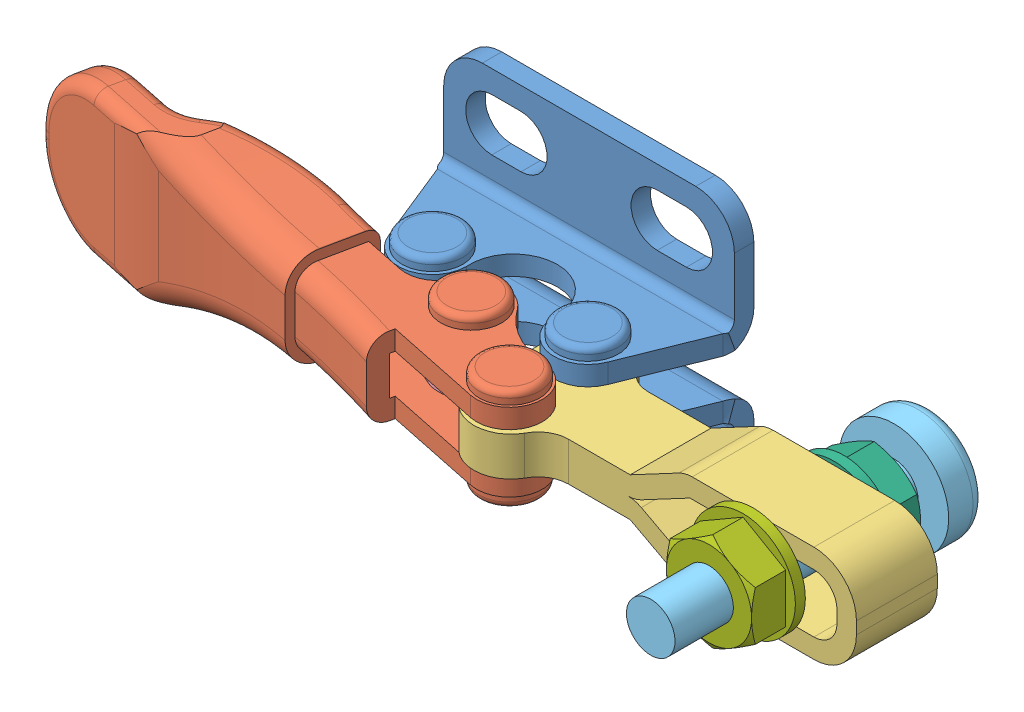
SolidWorks assembly ST-H205U-S.sldasm, configuration Default (file format 15000). Lengths in mm.
Overall size (69.16 23.7 23).
7 component instances, 7 part files, 0 mates.
Components (placement in the parent):
- ST-H205U-S_01-1: ST-H205U-S_01.SLDPRT [Default] at (1.5875 7.85 0) x (-1 0 0) z (0 0 -1) size (23.9 23.7 10.92)
- ST-H205U-S_02-1: ST-H205U-S_02.SLDPRT [Default] at (1.5875 7.85 0) x (-1 0 0) z (0 0 -1) size (43.29 14.29 10.36)
- ST-H205U-S_03-1: ST-H205U-S_03.SLDPRT [Default] at (1.5875 7.85 0) x (-1 0 0) z (0 0 -1) size (31.58 8 12.31)
- ST-H205U-S_04-1: ST-H205U-S_04.SLDPRT [Default] at (1.5875 7.85 0) x (-1 0 0) z (0 0 -1) size (11.17 3.2 7.98)
- ST-H205U-S_05-1: ST-H205U-S_05.SLDPRT [Default] at (34.4707 7.85 0.0028) x (-1 0 0) z (0 0 -1) size (9 9 23)
- ST-H205U-S_06-1: ST-H205U-S_06.SLDPRT [Default] at (34.4707 7.85 7.9372) x (0 1 0) z (0 0 -1) size (8.6 8.6 3.62)
- ST-H205U-S_07-1: ST-H205U-S_07.SLDPRT [Default] at (34.4707 7.85 14.5872) x (0 1 0) z (0 0 -1) size (8.6 8.6 3.62)
